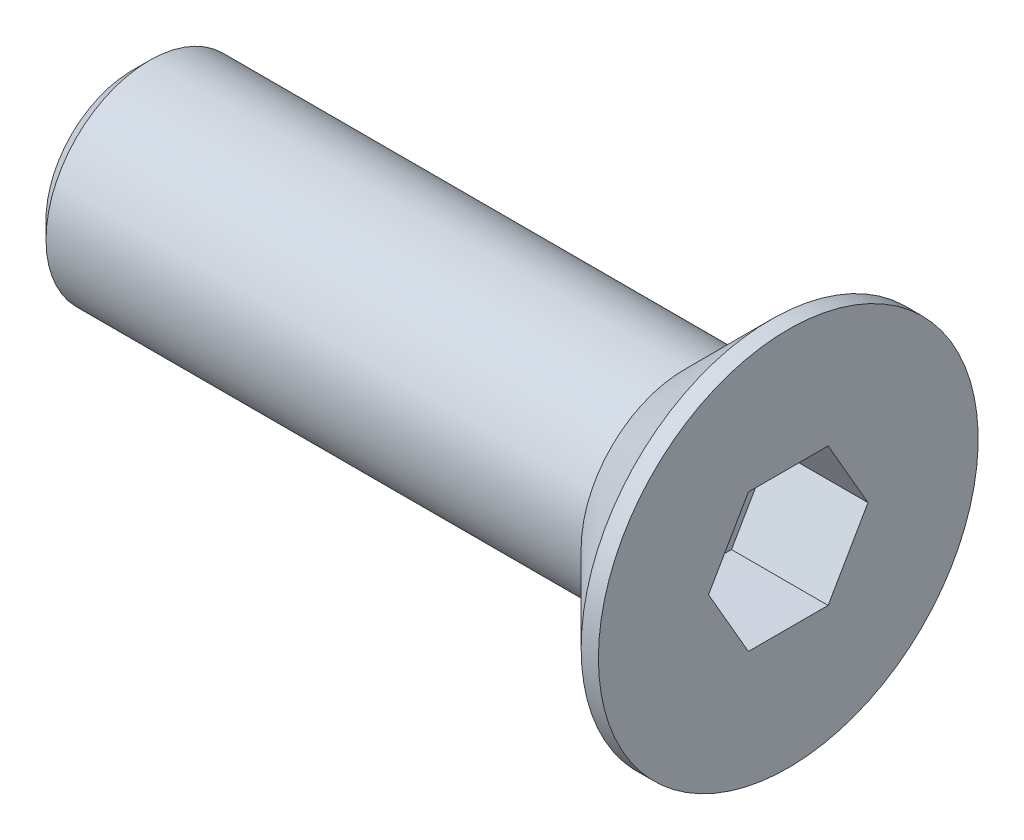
ISO-10303-21;
HEADER;
FILE_DESCRIPTION(('STEP AP214'),'2;1');
FILE_NAME('part.step','',(''),(''),'','','');
FILE_SCHEMA(('AUTOMOTIVE_DESIGN { 1 0 10303 214 1 1 1 1 }'));
ENDSEC;
DATA;
#1=APPLICATION_CONTEXT('core data for automotive mechanical design processes');
#2=APPLICATION_PROTOCOL_DEFINITION('international standard','automotive_design',2000,#1);
#3=PRODUCT_CONTEXT('',#1,'mechanical');
#4=PRODUCT('Part','Part','',(#3));
#5=PRODUCT_RELATED_PRODUCT_CATEGORY('part','',(#4));
#6=PRODUCT_DEFINITION_FORMATION('','',#4);
#7=PRODUCT_DEFINITION_CONTEXT('part definition',#1,'design');
#8=PRODUCT_DEFINITION('design','',#6,#7);
#9=PRODUCT_DEFINITION_SHAPE('','',#8);
#10=(LENGTH_UNIT() NAMED_UNIT(*) SI_UNIT(.MILLI.,.METRE.));
#11=(NAMED_UNIT(*) PLANE_ANGLE_UNIT() SI_UNIT($,.RADIAN.));
#12=(NAMED_UNIT(*) SI_UNIT($,.STERADIAN.) SOLID_ANGLE_UNIT());
#13=UNCERTAINTY_MEASURE_WITH_UNIT(LENGTH_MEASURE(1.E-05),#10,'distance_accuracy_value','');
#14=(GEOMETRIC_REPRESENTATION_CONTEXT(3) GLOBAL_UNCERTAINTY_ASSIGNED_CONTEXT((#13)) GLOBAL_UNIT_ASSIGNED_CONTEXT((#10,
#11,#12)) REPRESENTATION_CONTEXT('',''));
#15=CARTESIAN_POINT('',(0.,0.,0.));
#16=DIRECTION('',(0.,0.,1.));
#17=DIRECTION('',(1.,0.,0.));
#18=AXIS2_PLACEMENT_3D('',#15,#16,#17);
#19=CARTESIAN_POINT('',(0.,0.,0.));
#20=DIRECTION('',(1.,0.,0.));
#21=DIRECTION('',(0.,0.,-1.));
#22=AXIS2_PLACEMENT_3D('',#19,#20,#21);
#23=PLANE('',#22);
#24=CARTESIAN_POINT('',(0.,0.,0.));
#25=DIRECTION('',(1.,0.,0.));
#26=DIRECTION('',(0.,0.,-1.));
#27=AXIS2_PLACEMENT_3D('',#24,#25,#26);
#28=CIRCLE('',#27,2.5);
#29=CARTESIAN_POINT('',(0.,0.,-2.5));
#30=VERTEX_POINT('',#29);
#31=EDGE_CURVE('E37',#30,#30,#28,.F.);
#32=ORIENTED_EDGE('',*,*,#31,.T.);
#33=EDGE_LOOP('',(#32));
#34=FACE_BOUND('',#33,.T.);
#35=ADVANCED_FACE('F30',(#34),#23,.F.);
#36=CARTESIAN_POINT('',(-25.8284750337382,0.,0.));
#37=DIRECTION('',(-1.,0.,0.));
#38=DIRECTION('',(0.,0.,1.));
#39=AXIS2_PLACEMENT_3D('',#36,#37,#38);
#40=CYLINDRICAL_SURFACE('',#39,3.);
#41=CARTESIAN_POINT('',(0.5,0.,0.));
#42=DIRECTION('',(1.,0.,0.));
#43=DIRECTION('',(0.,0.,-1.));
#44=AXIS2_PLACEMENT_3D('',#41,#42,#43);
#45=CIRCLE('',#44,3.);
#46=CARTESIAN_POINT('',(0.5,0.,-3.));
#47=VERTEX_POINT('',#46);
#48=EDGE_CURVE('E11',#47,#47,#45,.T.);
#49=ORIENTED_EDGE('',*,*,#48,.T.);
#50=EDGE_LOOP('',(#49));
#51=FACE_BOUND('',#50,.T.);
#52=CARTESIAN_POINT('',(16.,0.,0.));
#53=DIRECTION('',(-1.,0.,0.));
#54=DIRECTION('',(0.,0.,1.));
#55=AXIS2_PLACEMENT_3D('',#52,#53,#54);
#56=CIRCLE('',#55,3.);
#57=CARTESIAN_POINT('',(16.,0.,3.));
#58=VERTEX_POINT('',#57);
#59=EDGE_CURVE('E144',#58,#58,#56,.T.);
#60=ORIENTED_EDGE('',*,*,#59,.T.);
#61=EDGE_LOOP('',(#60));
#62=FACE_BOUND('',#61,.T.);
#63=ADVANCED_FACE('F165',(#51,#62),#40,.T.);
#64=CARTESIAN_POINT('',(18.5,0.,0.));
#65=DIRECTION('',(1.,0.,0.));
#66=DIRECTION('',(0.,0.,-1.));
#67=AXIS2_PLACEMENT_3D('',#64,#65,#66);
#68=CONICAL_SURFACE('',#67,5.5,0.785398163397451);
#69=ORIENTED_EDGE('',*,*,#59,.F.);
#70=EDGE_LOOP('',(#69));
#71=FACE_BOUND('',#70,.T.);
#72=CARTESIAN_POINT('',(18.5,0.,0.));
#73=DIRECTION('',(-1.,0.,0.));
#74=DIRECTION('',(0.,0.,1.));
#75=AXIS2_PLACEMENT_3D('',#72,#73,#74);
#76=CIRCLE('',#75,5.5);
#77=CARTESIAN_POINT('',(18.5,0.,5.5));
#78=VERTEX_POINT('',#77);
#79=EDGE_CURVE('E141',#78,#78,#76,.T.);
#80=ORIENTED_EDGE('',*,*,#79,.T.);
#81=EDGE_LOOP('',(#80));
#82=FACE_BOUND('',#81,.T.);
#83=ADVANCED_FACE('F169',(#71,#82),#68,.T.);
#84=CARTESIAN_POINT('',(-25.8284750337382,0.,0.));
#85=DIRECTION('',(-1.,0.,0.));
#86=DIRECTION('',(0.,0.,1.));
#87=AXIS2_PLACEMENT_3D('',#84,#85,#86);
#88=CYLINDRICAL_SURFACE('',#87,5.5);
#89=ORIENTED_EDGE('',*,*,#79,.F.);
#90=EDGE_LOOP('',(#89));
#91=FACE_BOUND('',#90,.T.);
#92=CARTESIAN_POINT('',(19.,0.,0.));
#93=DIRECTION('',(-1.,0.,0.));
#94=DIRECTION('',(0.,0.,1.));
#95=AXIS2_PLACEMENT_3D('',#92,#93,#94);
#96=CIRCLE('',#95,5.5);
#97=CARTESIAN_POINT('',(19.,0.,5.5));
#98=VERTEX_POINT('',#97);
#99=EDGE_CURVE('E132',#98,#98,#96,.T.);
#100=ORIENTED_EDGE('',*,*,#99,.T.);
#101=EDGE_LOOP('',(#100));
#102=FACE_BOUND('',#101,.T.);
#103=ADVANCED_FACE('F161',(#91,#102),#88,.T.);
#104=CARTESIAN_POINT('',(19.,5.5,0.));
#105=DIRECTION('',(-1.,0.,0.));
#106=DIRECTION('',(0.,0.,1.));
#107=AXIS2_PLACEMENT_3D('',#104,#105,#106);
#108=PLANE('',#107);
#109=DIRECTION('',(0.,0.866025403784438,0.5));
#110=VECTOR('',#109,1.);
#111=CARTESIAN_POINT('',(19.,0.,-2.3094010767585));
#112=LINE('',#111,#110);
#113=CARTESIAN_POINT('',(19.,0.,-2.3094010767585));
#114=VERTEX_POINT('',#113);
#115=CARTESIAN_POINT('',(19.,2.,-1.15470053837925));
#116=VERTEX_POINT('',#115);
#117=EDGE_CURVE('E98',#114,#116,#112,.T.);
#118=ORIENTED_EDGE('',*,*,#117,.F.);
#119=DIRECTION('',(0.,0.866025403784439,-0.5));
#120=VECTOR('',#119,1.);
#121=CARTESIAN_POINT('',(19.,-2.,-1.15470053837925));
#122=LINE('',#121,#120);
#123=CARTESIAN_POINT('',(19.,-2.,-1.15470053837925));
#124=VERTEX_POINT('',#123);
#125=EDGE_CURVE('E44',#124,#114,#122,.T.);
#126=ORIENTED_EDGE('',*,*,#125,.F.);
#127=DIRECTION('',(0.,0.,-1.));
#128=VECTOR('',#127,1.);
#129=CARTESIAN_POINT('',(19.,-2.,1.15470053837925));
#130=LINE('',#129,#128);
#131=CARTESIAN_POINT('',(19.,-2.,1.15470053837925));
#132=VERTEX_POINT('',#131);
#133=EDGE_CURVE('E114',#132,#124,#130,.T.);
#134=ORIENTED_EDGE('',*,*,#133,.F.);
#135=DIRECTION('',(0.,-0.866025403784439,-0.5));
#136=VECTOR('',#135,1.);
#137=CARTESIAN_POINT('',(19.,0.,2.3094010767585));
#138=LINE('',#137,#136);
#139=CARTESIAN_POINT('',(19.,0.,2.3094010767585));
#140=VERTEX_POINT('',#139);
#141=EDGE_CURVE('E108',#140,#132,#138,.T.);
#142=ORIENTED_EDGE('',*,*,#141,.F.);
#143=DIRECTION('',(0.,-0.866025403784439,0.5));
#144=VECTOR('',#143,1.);
#145=CARTESIAN_POINT('',(19.,2.,1.15470053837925));
#146=LINE('',#145,#144);
#147=CARTESIAN_POINT('',(19.,2.,1.15470053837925));
#148=VERTEX_POINT('',#147);
#149=EDGE_CURVE('E106',#148,#140,#146,.T.);
#150=ORIENTED_EDGE('',*,*,#149,.F.);
#151=DIRECTION('',(0.,0.,1.));
#152=VECTOR('',#151,1.);
#153=CARTESIAN_POINT('',(19.,2.,-1.15470053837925));
#154=LINE('',#153,#152);
#155=EDGE_CURVE('E87',#116,#148,#154,.T.);
#156=ORIENTED_EDGE('',*,*,#155,.F.);
#157=EDGE_LOOP('',(#118,#126,#134,#142,#150,#156));
#158=FACE_BOUND('',#157,.T.);
#159=ORIENTED_EDGE('',*,*,#99,.F.);
#160=EDGE_LOOP('',(#159));
#161=FACE_BOUND('',#160,.T.);
#162=ADVANCED_FACE('F102',(#158,#161),#108,.F.);
#163=CARTESIAN_POINT('',(0.,0.,0.));
#164=DIRECTION('',(1.,0.,0.));
#165=DIRECTION('',(0.,0.,-1.));
#166=AXIS2_PLACEMENT_3D('',#163,#164,#165);
#167=CONICAL_SURFACE('',#166,2.5,0.785398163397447);
#168=ORIENTED_EDGE('',*,*,#48,.F.);
#169=EDGE_LOOP('',(#168));
#170=FACE_BOUND('',#169,.T.);
#171=ORIENTED_EDGE('',*,*,#31,.F.);
#172=EDGE_LOOP('',(#171));
#173=FACE_BOUND('',#172,.T.);
#174=ADVANCED_FACE('F150',(#170,#173),#167,.T.);
#175=CARTESIAN_POINT('',(16.2,-2.,-1.15470053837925));
#176=DIRECTION('',(0.,-0.5,-0.866025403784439));
#177=DIRECTION('',(0.,0.866025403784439,-0.5));
#178=AXIS2_PLACEMENT_3D('',#175,#176,#177);
#179=PLANE('',#178);
#180=ORIENTED_EDGE('',*,*,#125,.T.);
#181=DIRECTION('',(1.,0.,0.));
#182=VECTOR('',#181,1.);
#183=CARTESIAN_POINT('',(16.2,0.,-2.3094010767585));
#184=LINE('',#183,#182);
#185=CARTESIAN_POINT('',(16.2,0.,-2.3094010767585));
#186=VERTEX_POINT('',#185);
#187=EDGE_CURVE('E95',#186,#114,#184,.T.);
#188=ORIENTED_EDGE('',*,*,#187,.F.);
#189=DIRECTION('',(0.,0.866025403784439,-0.5));
#190=VECTOR('',#189,1.);
#191=CARTESIAN_POINT('',(16.2,-2.,-1.15470053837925));
#192=LINE('',#191,#190);
#193=CARTESIAN_POINT('',(16.2,-2.,-1.15470053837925));
#194=VERTEX_POINT('',#193);
#195=EDGE_CURVE('E116',#194,#186,#192,.T.);
#196=ORIENTED_EDGE('',*,*,#195,.F.);
#197=DIRECTION('',(1.,0.,0.));
#198=VECTOR('',#197,1.);
#199=CARTESIAN_POINT('',(16.2,-2.,-1.15470053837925));
#200=LINE('',#199,#198);
#201=EDGE_CURVE('E51',#194,#124,#200,.T.);
#202=ORIENTED_EDGE('',*,*,#201,.T.);
#203=EDGE_LOOP('',(#180,#188,#196,#202));
#204=FACE_BOUND('',#203,.T.);
#205=ADVANCED_FACE('F152',(#204),#179,.F.);
#206=CARTESIAN_POINT('',(16.2,-2.,1.15470053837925));
#207=DIRECTION('',(0.,-1.,0.));
#208=DIRECTION('',(0.,0.,-1.));
#209=AXIS2_PLACEMENT_3D('',#206,#207,#208);
#210=PLANE('',#209);
#211=ORIENTED_EDGE('',*,*,#133,.T.);
#212=ORIENTED_EDGE('',*,*,#201,.F.);
#213=DIRECTION('',(0.,0.,-1.));
#214=VECTOR('',#213,1.);
#215=CARTESIAN_POINT('',(16.2,-2.,1.15470053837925));
#216=LINE('',#215,#214);
#217=CARTESIAN_POINT('',(16.2,-2.,1.15470053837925));
#218=VERTEX_POINT('',#217);
#219=EDGE_CURVE('E128',#218,#194,#216,.T.);
#220=ORIENTED_EDGE('',*,*,#219,.F.);
#221=DIRECTION('',(1.,0.,0.));
#222=VECTOR('',#221,1.);
#223=CARTESIAN_POINT('',(16.2,-2.,1.15470053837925));
#224=LINE('',#223,#222);
#225=EDGE_CURVE('E133',#218,#132,#224,.T.);
#226=ORIENTED_EDGE('',*,*,#225,.T.);
#227=EDGE_LOOP('',(#211,#212,#220,#226));
#228=FACE_BOUND('',#227,.T.);
#229=ADVANCED_FACE('F159',(#228),#210,.F.);
#230=CARTESIAN_POINT('',(16.2,0.,2.3094010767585));
#231=DIRECTION('',(0.,-0.5,0.866025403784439));
#232=DIRECTION('',(0.,-0.866025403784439,-0.5));
#233=AXIS2_PLACEMENT_3D('',#230,#231,#232);
#234=PLANE('',#233);
#235=ORIENTED_EDGE('',*,*,#141,.T.);
#236=ORIENTED_EDGE('',*,*,#225,.F.);
#237=DIRECTION('',(0.,-0.866025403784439,-0.5));
#238=VECTOR('',#237,1.);
#239=CARTESIAN_POINT('',(16.2,0.,2.3094010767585));
#240=LINE('',#239,#238);
#241=CARTESIAN_POINT('',(16.2,0.,2.3094010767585));
#242=VERTEX_POINT('',#241);
#243=EDGE_CURVE('E125',#242,#218,#240,.T.);
#244=ORIENTED_EDGE('',*,*,#243,.F.);
#245=DIRECTION('',(1.,0.,0.));
#246=VECTOR('',#245,1.);
#247=CARTESIAN_POINT('',(16.2,0.,2.3094010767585));
#248=LINE('',#247,#246);
#249=EDGE_CURVE('E135',#242,#140,#248,.T.);
#250=ORIENTED_EDGE('',*,*,#249,.T.);
#251=EDGE_LOOP('',(#235,#236,#244,#250));
#252=FACE_BOUND('',#251,.T.);
#253=ADVANCED_FACE('F209',(#252),#234,.F.);
#254=CARTESIAN_POINT('',(16.2,2.,1.15470053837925));
#255=DIRECTION('',(0.,0.5,0.866025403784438));
#256=DIRECTION('',(0.,-0.866025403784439,0.5));
#257=AXIS2_PLACEMENT_3D('',#254,#255,#256);
#258=PLANE('',#257);
#259=ORIENTED_EDGE('',*,*,#149,.T.);
#260=ORIENTED_EDGE('',*,*,#249,.F.);
#261=DIRECTION('',(0.,-0.866025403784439,0.5));
#262=VECTOR('',#261,1.);
#263=CARTESIAN_POINT('',(16.2,2.,1.15470053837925));
#264=LINE('',#263,#262);
#265=CARTESIAN_POINT('',(16.2,2.,1.15470053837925));
#266=VERTEX_POINT('',#265);
#267=EDGE_CURVE('E122',#266,#242,#264,.T.);
#268=ORIENTED_EDGE('',*,*,#267,.F.);
#269=DIRECTION('',(1.,0.,0.));
#270=VECTOR('',#269,1.);
#271=CARTESIAN_POINT('',(16.2,2.,1.15470053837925));
#272=LINE('',#271,#270);
#273=EDGE_CURVE('E94',#266,#148,#272,.T.);
#274=ORIENTED_EDGE('',*,*,#273,.T.);
#275=EDGE_LOOP('',(#259,#260,#268,#274));
#276=FACE_BOUND('',#275,.T.);
#277=ADVANCED_FACE('F218',(#276),#258,.F.);
#278=CARTESIAN_POINT('',(16.2,2.,-1.15470053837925));
#279=DIRECTION('',(0.,1.,0.));
#280=DIRECTION('',(0.,0.,1.));
#281=AXIS2_PLACEMENT_3D('',#278,#279,#280);
#282=PLANE('',#281);
#283=ORIENTED_EDGE('',*,*,#155,.T.);
#284=ORIENTED_EDGE('',*,*,#273,.F.);
#285=DIRECTION('',(0.,0.,1.));
#286=VECTOR('',#285,1.);
#287=CARTESIAN_POINT('',(16.2,2.,-1.15470053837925));
#288=LINE('',#287,#286);
#289=CARTESIAN_POINT('',(16.2,2.,-1.15470053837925));
#290=VERTEX_POINT('',#289);
#291=EDGE_CURVE('E90',#290,#266,#288,.T.);
#292=ORIENTED_EDGE('',*,*,#291,.F.);
#293=DIRECTION('',(1.,0.,0.));
#294=VECTOR('',#293,1.);
#295=CARTESIAN_POINT('',(16.2,2.,-1.15470053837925));
#296=LINE('',#295,#294);
#297=EDGE_CURVE('E83',#290,#116,#296,.T.);
#298=ORIENTED_EDGE('',*,*,#297,.T.);
#299=EDGE_LOOP('',(#283,#284,#292,#298));
#300=FACE_BOUND('',#299,.T.);
#301=ADVANCED_FACE('F85',(#300),#282,.F.);
#302=CARTESIAN_POINT('',(16.2,0.,-2.3094010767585));
#303=DIRECTION('',(0.,0.5,-0.866025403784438));
#304=DIRECTION('',(0.,0.866025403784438,0.5));
#305=AXIS2_PLACEMENT_3D('',#302,#303,#304);
#306=PLANE('',#305);
#307=ORIENTED_EDGE('',*,*,#117,.T.);
#308=ORIENTED_EDGE('',*,*,#297,.F.);
#309=DIRECTION('',(0.,0.866025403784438,0.5));
#310=VECTOR('',#309,1.);
#311=CARTESIAN_POINT('',(16.2,0.,-2.3094010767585));
#312=LINE('',#311,#310);
#313=EDGE_CURVE('E119',#186,#290,#312,.T.);
#314=ORIENTED_EDGE('',*,*,#313,.F.);
#315=ORIENTED_EDGE('',*,*,#187,.T.);
#316=EDGE_LOOP('',(#307,#308,#314,#315));
#317=FACE_BOUND('',#316,.T.);
#318=ADVANCED_FACE('F99',(#317),#306,.F.);
#319=CARTESIAN_POINT('',(16.2,-2.,-1.15470053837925));
#320=DIRECTION('',(-1.,0.,0.));
#321=DIRECTION('',(0.,0.,1.));
#322=AXIS2_PLACEMENT_3D('',#319,#320,#321);
#323=PLANE('',#322);
#324=ORIENTED_EDGE('',*,*,#195,.T.);
#325=ORIENTED_EDGE('',*,*,#313,.T.);
#326=ORIENTED_EDGE('',*,*,#291,.T.);
#327=ORIENTED_EDGE('',*,*,#267,.T.);
#328=ORIENTED_EDGE('',*,*,#243,.T.);
#329=ORIENTED_EDGE('',*,*,#219,.T.);
#330=EDGE_LOOP('',(#324,#325,#326,#327,#328,#329));
#331=FACE_BOUND('',#330,.T.);
#332=ADVANCED_FACE('F245',(#331),#323,.F.);
#333=CLOSED_SHELL('',(#35,#63,#83,#103,#162,#174,#205,#229,#253,#277,#301,#318,#332));
#334=MANIFOLD_SOLID_BREP('B2',#333);
#335=ADVANCED_BREP_SHAPE_REPRESENTATION('',(#18,#334),#14);
#336=SHAPE_DEFINITION_REPRESENTATION(#9,#335);
ENDSEC;
END-ISO-10303-21;
